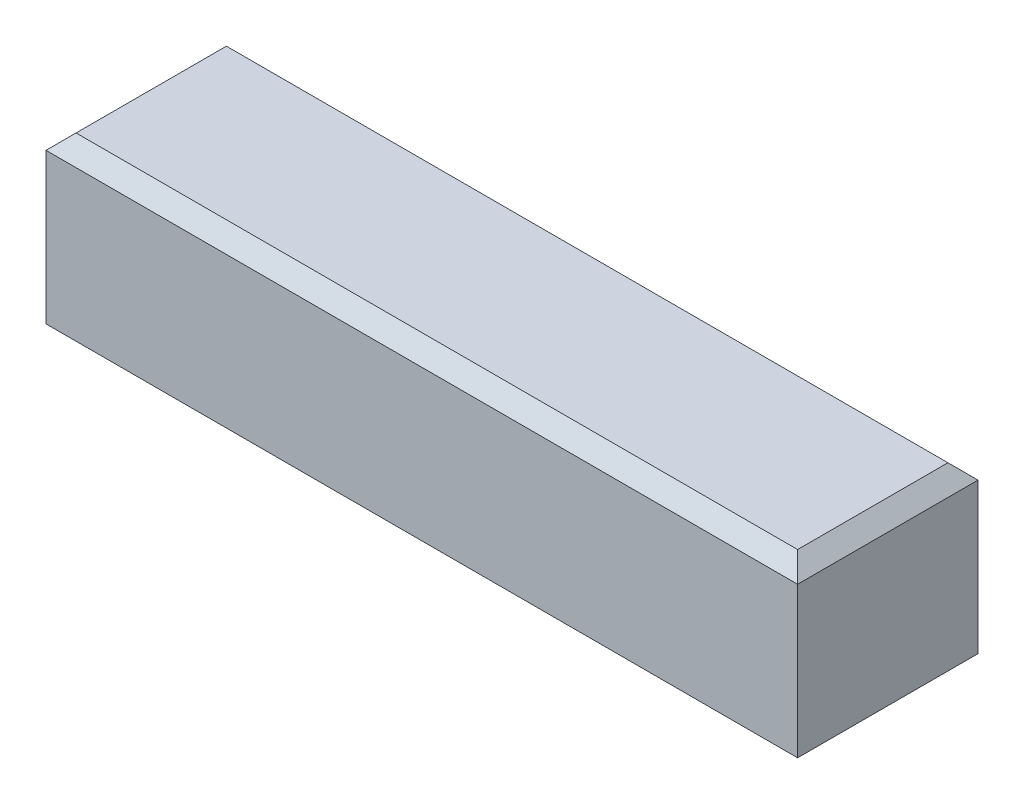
ISO-10303-21;
HEADER;
FILE_DESCRIPTION(('STEP AP214'),'2;1');
FILE_NAME('part.step','',(''),(''),'','','');
FILE_SCHEMA(('AUTOMOTIVE_DESIGN { 1 0 10303 214 1 1 1 1 }'));
ENDSEC;
DATA;
#1=APPLICATION_CONTEXT('core data for automotive mechanical design processes');
#2=APPLICATION_PROTOCOL_DEFINITION('international standard','automotive_design',2000,#1);
#3=PRODUCT_CONTEXT('',#1,'mechanical');
#4=PRODUCT('Part','Part','',(#3));
#5=PRODUCT_RELATED_PRODUCT_CATEGORY('part','',(#4));
#6=PRODUCT_DEFINITION_FORMATION('','',#4);
#7=PRODUCT_DEFINITION_CONTEXT('part definition',#1,'design');
#8=PRODUCT_DEFINITION('design','',#6,#7);
#9=PRODUCT_DEFINITION_SHAPE('','',#8);
#10=(LENGTH_UNIT() NAMED_UNIT(*) SI_UNIT(.MILLI.,.METRE.));
#11=(NAMED_UNIT(*) PLANE_ANGLE_UNIT() SI_UNIT($,.RADIAN.));
#12=(NAMED_UNIT(*) SI_UNIT($,.STERADIAN.) SOLID_ANGLE_UNIT());
#13=UNCERTAINTY_MEASURE_WITH_UNIT(LENGTH_MEASURE(1.E-05),#10,'distance_accuracy_value','');
#14=(GEOMETRIC_REPRESENTATION_CONTEXT(3) GLOBAL_UNCERTAINTY_ASSIGNED_CONTEXT((#13)) GLOBAL_UNIT_ASSIGNED_CONTEXT((#10,
#11,#12)) REPRESENTATION_CONTEXT('',''));
#15=CARTESIAN_POINT('',(0.,0.,0.));
#16=DIRECTION('',(0.,0.,1.));
#17=DIRECTION('',(1.,0.,0.));
#18=AXIS2_PLACEMENT_3D('',#15,#16,#17);
#19=CARTESIAN_POINT('',(-12.5,3.,6.));
#20=DIRECTION('',(1.,0.,0.));
#21=DIRECTION('',(0.,0.,-1.));
#22=AXIS2_PLACEMENT_3D('',#19,#20,#21);
#23=PLANE('',#22);
#24=DIRECTION('',(0.,-1.,0.));
#25=VECTOR('',#24,1.);
#26=CARTESIAN_POINT('',(-12.5,3.,0.));
#27=LINE('',#26,#25);
#28=CARTESIAN_POINT('',(-12.5,2.5,0.));
#29=VERTEX_POINT('',#28);
#30=CARTESIAN_POINT('',(-12.5,-2.49999999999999,0.));
#31=VERTEX_POINT('',#30);
#32=EDGE_CURVE('E132',#29,#31,#27,.T.);
#33=ORIENTED_EDGE('',*,*,#32,.T.);
#34=DIRECTION('',(0.,0.,1.));
#35=VECTOR('',#34,1.);
#36=CARTESIAN_POINT('',(-12.5,-2.49999999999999,6.));
#37=LINE('',#36,#35);
#38=CARTESIAN_POINT('',(-12.5,-2.49999999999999,6.));
#39=VERTEX_POINT('',#38);
#40=EDGE_CURVE('E151',#31,#39,#37,.T.);
#41=ORIENTED_EDGE('',*,*,#40,.T.);
#42=DIRECTION('',(0.,-1.,0.));
#43=VECTOR('',#42,1.);
#44=CARTESIAN_POINT('',(-12.5,3.,6.));
#45=LINE('',#44,#43);
#46=CARTESIAN_POINT('',(-12.5,2.49999999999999,6.));
#47=VERTEX_POINT('',#46);
#48=EDGE_CURVE('E131',#47,#39,#45,.T.);
#49=ORIENTED_EDGE('',*,*,#48,.F.);
#50=DIRECTION('',(0.,0.,-1.));
#51=VECTOR('',#50,1.);
#52=CARTESIAN_POINT('',(-12.5,2.49999999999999,6.));
#53=LINE('',#52,#51);
#54=EDGE_CURVE('E148',#47,#29,#53,.T.);
#55=ORIENTED_EDGE('',*,*,#54,.T.);
#56=EDGE_LOOP('',(#33,#41,#49,#55));
#57=FACE_BOUND('',#56,.T.);
#58=ADVANCED_FACE('F30',(#57),#23,.F.);
#59=CARTESIAN_POINT('',(-12.5,-3.,6.));
#60=DIRECTION('',(0.,1.,0.));
#61=DIRECTION('',(0.,0.,1.));
#62=AXIS2_PLACEMENT_3D('',#59,#60,#61);
#63=PLANE('',#62);
#64=DIRECTION('',(0.,0.,-1.));
#65=VECTOR('',#64,1.);
#66=CARTESIAN_POINT('',(-12.,-3.,6.));
#67=LINE('',#66,#65);
#68=CARTESIAN_POINT('',(-12.,-3.,5.5));
#69=VERTEX_POINT('',#68);
#70=CARTESIAN_POINT('',(-12.,-3.,0.500000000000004));
#71=VERTEX_POINT('',#70);
#72=EDGE_CURVE('E143',#69,#71,#67,.T.);
#73=ORIENTED_EDGE('',*,*,#72,.T.);
#74=DIRECTION('',(1.,0.,0.));
#75=VECTOR('',#74,1.);
#76=CARTESIAN_POINT('',(-12.5,-3.,0.500000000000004));
#77=LINE('',#76,#75);
#78=CARTESIAN_POINT('',(12.,-3.,0.500000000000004));
#79=VERTEX_POINT('',#78);
#80=EDGE_CURVE('E146',#71,#79,#77,.T.);
#81=ORIENTED_EDGE('',*,*,#80,.T.);
#82=DIRECTION('',(0.,0.,1.));
#83=VECTOR('',#82,1.);
#84=CARTESIAN_POINT('',(12.,-3.,6.));
#85=LINE('',#84,#83);
#86=CARTESIAN_POINT('',(12.,-3.,5.5));
#87=VERTEX_POINT('',#86);
#88=EDGE_CURVE('E100',#79,#87,#85,.T.);
#89=ORIENTED_EDGE('',*,*,#88,.T.);
#90=DIRECTION('',(-1.,0.,0.));
#91=VECTOR('',#90,1.);
#92=CARTESIAN_POINT('',(-12.5,-3.,5.5));
#93=LINE('',#92,#91);
#94=EDGE_CURVE('E126',#87,#69,#93,.T.);
#95=ORIENTED_EDGE('',*,*,#94,.T.);
#96=EDGE_LOOP('',(#73,#81,#89,#95));
#97=FACE_BOUND('',#96,.T.);
#98=ADVANCED_FACE('F201',(#97),#63,.F.);
#99=CARTESIAN_POINT('',(12.5,3.,6.));
#100=DIRECTION('',(-1.,0.,0.));
#101=DIRECTION('',(0.,-1.,0.));
#102=AXIS2_PLACEMENT_3D('',#99,#100,#101);
#103=PLANE('',#102);
#104=DIRECTION('',(0.,1.,0.));
#105=VECTOR('',#104,1.);
#106=CARTESIAN_POINT('',(12.5,3.,6.));
#107=LINE('',#106,#105);
#108=CARTESIAN_POINT('',(12.5,-2.49999999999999,6.));
#109=VERTEX_POINT('',#108);
#110=CARTESIAN_POINT('',(12.5,2.49999999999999,6.));
#111=VERTEX_POINT('',#110);
#112=EDGE_CURVE('E124',#109,#111,#107,.T.);
#113=ORIENTED_EDGE('',*,*,#112,.F.);
#114=DIRECTION('',(0.,0.,-1.));
#115=VECTOR('',#114,1.);
#116=CARTESIAN_POINT('',(12.5,-2.49999999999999,6.));
#117=LINE('',#116,#115);
#118=CARTESIAN_POINT('',(12.5,-2.49999999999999,0.));
#119=VERTEX_POINT('',#118);
#120=EDGE_CURVE('E98',#109,#119,#117,.T.);
#121=ORIENTED_EDGE('',*,*,#120,.T.);
#122=DIRECTION('',(0.,1.,0.));
#123=VECTOR('',#122,1.);
#124=CARTESIAN_POINT('',(12.5,3.,0.));
#125=LINE('',#124,#123);
#126=CARTESIAN_POINT('',(12.5,2.5,0.));
#127=VERTEX_POINT('',#126);
#128=EDGE_CURVE('E121',#119,#127,#125,.T.);
#129=ORIENTED_EDGE('',*,*,#128,.T.);
#130=DIRECTION('',(0.,0.,1.));
#131=VECTOR('',#130,1.);
#132=CARTESIAN_POINT('',(12.5,2.5,6.));
#133=LINE('',#132,#131);
#134=EDGE_CURVE('E127',#127,#111,#133,.T.);
#135=ORIENTED_EDGE('',*,*,#134,.T.);
#136=EDGE_LOOP('',(#113,#121,#129,#135));
#137=FACE_BOUND('',#136,.T.);
#138=ADVANCED_FACE('F120',(#137),#103,.F.);
#139=CARTESIAN_POINT('',(-12.5,3.,6.));
#140=DIRECTION('',(0.,-1.,0.));
#141=DIRECTION('',(0.,0.,-1.));
#142=AXIS2_PLACEMENT_3D('',#139,#140,#141);
#143=PLANE('',#142);
#144=DIRECTION('',(0.,0.,-1.));
#145=VECTOR('',#144,1.);
#146=CARTESIAN_POINT('',(12.,3.,6.));
#147=LINE('',#146,#145);
#148=CARTESIAN_POINT('',(12.,3.,5.5));
#149=VERTEX_POINT('',#148);
#150=CARTESIAN_POINT('',(12.,3.,0.500000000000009));
#151=VERTEX_POINT('',#150);
#152=EDGE_CURVE('E49',#149,#151,#147,.T.);
#153=ORIENTED_EDGE('',*,*,#152,.T.);
#154=DIRECTION('',(-1.,0.,0.));
#155=VECTOR('',#154,1.);
#156=CARTESIAN_POINT('',(-12.5,3.,0.500000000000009));
#157=LINE('',#156,#155);
#158=CARTESIAN_POINT('',(-12.,3.,0.500000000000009));
#159=VERTEX_POINT('',#158);
#160=EDGE_CURVE('E44',#151,#159,#157,.T.);
#161=ORIENTED_EDGE('',*,*,#160,.T.);
#162=DIRECTION('',(0.,0.,1.));
#163=VECTOR('',#162,1.);
#164=CARTESIAN_POINT('',(-12.,3.,6.));
#165=LINE('',#164,#163);
#166=CARTESIAN_POINT('',(-12.,3.,5.5));
#167=VERTEX_POINT('',#166);
#168=EDGE_CURVE('E156',#159,#167,#165,.T.);
#169=ORIENTED_EDGE('',*,*,#168,.T.);
#170=DIRECTION('',(1.,0.,0.));
#171=VECTOR('',#170,1.);
#172=CARTESIAN_POINT('',(12.5,3.,5.5));
#173=LINE('',#172,#171);
#174=EDGE_CURVE('E153',#167,#149,#173,.T.);
#175=ORIENTED_EDGE('',*,*,#174,.T.);
#176=EDGE_LOOP('',(#153,#161,#169,#175));
#177=FACE_BOUND('',#176,.T.);
#178=ADVANCED_FACE('F193',(#177),#143,.F.);
#179=CARTESIAN_POINT('',(-12.5,-3.,6.));
#180=DIRECTION('',(0.,0.,1.));
#181=DIRECTION('',(1.,0.,0.));
#182=AXIS2_PLACEMENT_3D('',#179,#180,#181);
#183=PLANE('',#182);
#184=ORIENTED_EDGE('',*,*,#112,.T.);
#185=DIRECTION('',(-1.,0.,0.));
#186=VECTOR('',#185,1.);
#187=CARTESIAN_POINT('',(-12.5,2.49999999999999,6.));
#188=LINE('',#187,#186);
#189=EDGE_CURVE('E11',#111,#47,#188,.T.);
#190=ORIENTED_EDGE('',*,*,#189,.T.);
#191=ORIENTED_EDGE('',*,*,#48,.T.);
#192=DIRECTION('',(1.,0.,0.));
#193=VECTOR('',#192,1.);
#194=CARTESIAN_POINT('',(12.5,-2.49999999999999,6.));
#195=LINE('',#194,#193);
#196=EDGE_CURVE('E37',#39,#109,#195,.T.);
#197=ORIENTED_EDGE('',*,*,#196,.T.);
#198=EDGE_LOOP('',(#184,#190,#191,#197));
#199=FACE_BOUND('',#198,.T.);
#200=ADVANCED_FACE('F161',(#199),#183,.T.);
#201=CARTESIAN_POINT('',(-12.5,-3.,0.));
#202=DIRECTION('',(0.,0.,1.));
#203=DIRECTION('',(1.,0.,0.));
#204=AXIS2_PLACEMENT_3D('',#201,#202,#203);
#205=PLANE('',#204);
#206=ORIENTED_EDGE('',*,*,#128,.F.);
#207=DIRECTION('',(-1.,0.,0.));
#208=VECTOR('',#207,1.);
#209=CARTESIAN_POINT('',(-12.5,-2.49999999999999,0.));
#210=LINE('',#209,#208);
#211=EDGE_CURVE('E107',#119,#31,#210,.T.);
#212=ORIENTED_EDGE('',*,*,#211,.T.);
#213=ORIENTED_EDGE('',*,*,#32,.F.);
#214=DIRECTION('',(1.,0.,0.));
#215=VECTOR('',#214,1.);
#216=CARTESIAN_POINT('',(-12.5,2.5,0.));
#217=LINE('',#216,#215);
#218=EDGE_CURVE('E115',#29,#127,#217,.T.);
#219=ORIENTED_EDGE('',*,*,#218,.T.);
#220=EDGE_LOOP('',(#206,#212,#213,#219));
#221=FACE_BOUND('',#220,.T.);
#222=ADVANCED_FACE('F129',(#221),#205,.F.);
#223=CARTESIAN_POINT('',(-12.,-3.,6.));
#224=DIRECTION('',(0.707106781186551,0.707106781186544,0.));
#225=DIRECTION('',(-0.707106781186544,0.707106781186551,0.));
#226=AXIS2_PLACEMENT_3D('',#223,#224,#225);
#227=PLANE('',#226);
#228=DIRECTION('',(-0.577350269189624,0.57735026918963,-0.577350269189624));
#229=VECTOR('',#228,1.);
#230=CARTESIAN_POINT('',(-12.1666666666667,-2.83333333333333,0.333333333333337));
#231=LINE('',#230,#229);
#232=EDGE_CURVE('E110',#71,#31,#231,.T.);
#233=ORIENTED_EDGE('',*,*,#232,.F.);
#234=ORIENTED_EDGE('',*,*,#72,.F.);
#235=DIRECTION('',(-0.577350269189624,0.57735026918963,0.577350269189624));
#236=VECTOR('',#235,1.);
#237=CARTESIAN_POINT('',(-12.5,-2.49999999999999,6.));
#238=LINE('',#237,#236);
#239=EDGE_CURVE('E136',#39,#69,#238,.F.);
#240=ORIENTED_EDGE('',*,*,#239,.F.);
#241=ORIENTED_EDGE('',*,*,#40,.F.);
#242=EDGE_LOOP('',(#233,#234,#240,#241));
#243=FACE_BOUND('',#242,.T.);
#244=ADVANCED_FACE('F212',(#243),#227,.F.);
#245=CARTESIAN_POINT('',(-12.5,-2.49999999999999,6.));
#246=DIRECTION('',(0.,-0.707106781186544,0.707106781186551));
#247=DIRECTION('',(0.,-0.707106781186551,-0.707106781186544));
#248=AXIS2_PLACEMENT_3D('',#245,#246,#247);
#249=PLANE('',#248);
#250=ORIENTED_EDGE('',*,*,#239,.T.);
#251=ORIENTED_EDGE('',*,*,#94,.F.);
#252=DIRECTION('',(-0.577350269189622,-0.57735026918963,-0.577350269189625));
#253=VECTOR('',#252,1.);
#254=CARTESIAN_POINT('',(4.16666666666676,-10.8333333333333,-2.33333333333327));
#255=LINE('',#254,#253);
#256=EDGE_CURVE('E103',#109,#87,#255,.T.);
#257=ORIENTED_EDGE('',*,*,#256,.F.);
#258=ORIENTED_EDGE('',*,*,#196,.F.);
#259=EDGE_LOOP('',(#250,#251,#257,#258));
#260=FACE_BOUND('',#259,.T.);
#261=ADVANCED_FACE('F167',(#260),#249,.T.);
#262=CARTESIAN_POINT('',(-12.5,-3.,0.500000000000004));
#263=DIRECTION('',(0.,0.707106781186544,0.707106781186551));
#264=DIRECTION('',(0.,-0.707106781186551,0.707106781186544));
#265=AXIS2_PLACEMENT_3D('',#262,#263,#264);
#266=PLANE('',#265);
#267=ORIENTED_EDGE('',*,*,#232,.T.);
#268=ORIENTED_EDGE('',*,*,#211,.F.);
#269=DIRECTION('',(-0.577350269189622,-0.57735026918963,0.577350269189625));
#270=VECTOR('',#269,1.);
#271=CARTESIAN_POINT('',(3.83333333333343,-11.1666666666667,8.66666666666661));
#272=LINE('',#271,#270);
#273=EDGE_CURVE('E94',#79,#119,#272,.F.);
#274=ORIENTED_EDGE('',*,*,#273,.F.);
#275=ORIENTED_EDGE('',*,*,#80,.F.);
#276=EDGE_LOOP('',(#267,#268,#274,#275));
#277=FACE_BOUND('',#276,.T.);
#278=ADVANCED_FACE('F108',(#277),#266,.F.);
#279=CARTESIAN_POINT('',(12.5,-2.49999999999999,6.));
#280=DIRECTION('',(-0.707106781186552,0.707106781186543,0.));
#281=DIRECTION('',(-0.707106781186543,-0.707106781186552,0.));
#282=AXIS2_PLACEMENT_3D('',#279,#280,#281);
#283=PLANE('',#282);
#284=ORIENTED_EDGE('',*,*,#256,.T.);
#285=ORIENTED_EDGE('',*,*,#88,.F.);
#286=ORIENTED_EDGE('',*,*,#273,.T.);
#287=ORIENTED_EDGE('',*,*,#120,.F.);
#288=EDGE_LOOP('',(#284,#285,#286,#287));
#289=FACE_BOUND('',#288,.T.);
#290=ADVANCED_FACE('F96',(#289),#283,.F.);
#291=CARTESIAN_POINT('',(12.,3.,6.));
#292=DIRECTION('',(-0.707106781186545,-0.70710678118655,0.));
#293=DIRECTION('',(0.70710678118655,-0.707106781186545,0.));
#294=AXIS2_PLACEMENT_3D('',#291,#292,#293);
#295=PLANE('',#294);
#296=DIRECTION('',(0.577350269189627,-0.577350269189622,-0.577350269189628));
#297=VECTOR('',#296,1.);
#298=CARTESIAN_POINT('',(3.8333333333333,11.1666666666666,8.66666666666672));
#299=LINE('',#298,#297);
#300=EDGE_CURVE('E174',#151,#127,#299,.T.);
#301=ORIENTED_EDGE('',*,*,#300,.F.);
#302=ORIENTED_EDGE('',*,*,#152,.F.);
#303=DIRECTION('',(0.577350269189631,-0.577350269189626,0.57735026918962));
#304=VECTOR('',#303,1.);
#305=CARTESIAN_POINT('',(4.16666666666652,10.8333333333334,-2.33333333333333));
#306=LINE('',#305,#304);
#307=EDGE_CURVE('E104',#111,#149,#306,.F.);
#308=ORIENTED_EDGE('',*,*,#307,.F.);
#309=ORIENTED_EDGE('',*,*,#134,.F.);
#310=EDGE_LOOP('',(#301,#302,#308,#309));
#311=FACE_BOUND('',#310,.T.);
#312=ADVANCED_FACE('F226',(#311),#295,.F.);
#313=CARTESIAN_POINT('',(-12.5,2.49999999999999,6.));
#314=DIRECTION('',(0.,0.707106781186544,0.707106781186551));
#315=DIRECTION('',(0.,-0.707106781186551,0.707106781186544));
#316=AXIS2_PLACEMENT_3D('',#313,#314,#315);
#317=PLANE('',#316);
#318=ORIENTED_EDGE('',*,*,#307,.T.);
#319=ORIENTED_EDGE('',*,*,#174,.F.);
#320=DIRECTION('',(0.577350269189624,0.57735026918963,-0.577350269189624));
#321=VECTOR('',#320,1.);
#322=CARTESIAN_POINT('',(-12.5,2.49999999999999,6.));
#323=LINE('',#322,#321);
#324=EDGE_CURVE('E177',#47,#167,#323,.T.);
#325=ORIENTED_EDGE('',*,*,#324,.F.);
#326=ORIENTED_EDGE('',*,*,#189,.F.);
#327=EDGE_LOOP('',(#318,#319,#325,#326));
#328=FACE_BOUND('',#327,.T.);
#329=ADVANCED_FACE('F192',(#328),#317,.T.);
#330=CARTESIAN_POINT('',(-12.5,3.,0.500000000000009));
#331=DIRECTION('',(0.,-0.707106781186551,0.707106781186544));
#332=DIRECTION('',(0.,-0.707106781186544,-0.707106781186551));
#333=AXIS2_PLACEMENT_3D('',#330,#331,#332);
#334=PLANE('',#333);
#335=ORIENTED_EDGE('',*,*,#300,.T.);
#336=ORIENTED_EDGE('',*,*,#218,.F.);
#337=DIRECTION('',(0.57735026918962,0.577350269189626,0.577350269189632));
#338=VECTOR('',#337,1.);
#339=CARTESIAN_POINT('',(-12.1666666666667,2.83333333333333,0.333333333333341));
#340=LINE('',#339,#338);
#341=EDGE_CURVE('E179',#159,#29,#340,.F.);
#342=ORIENTED_EDGE('',*,*,#341,.F.);
#343=ORIENTED_EDGE('',*,*,#160,.F.);
#344=EDGE_LOOP('',(#335,#336,#342,#343));
#345=FACE_BOUND('',#344,.T.);
#346=ADVANCED_FACE('F185',(#345),#334,.F.);
#347=CARTESIAN_POINT('',(-12.5,2.49999999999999,6.));
#348=DIRECTION('',(0.707106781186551,-0.707106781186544,0.));
#349=DIRECTION('',(0.707106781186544,0.707106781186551,0.));
#350=AXIS2_PLACEMENT_3D('',#347,#348,#349);
#351=PLANE('',#350);
#352=ORIENTED_EDGE('',*,*,#324,.T.);
#353=ORIENTED_EDGE('',*,*,#168,.F.);
#354=ORIENTED_EDGE('',*,*,#341,.T.);
#355=ORIENTED_EDGE('',*,*,#54,.F.);
#356=EDGE_LOOP('',(#352,#353,#354,#355));
#357=FACE_BOUND('',#356,.T.);
#358=ADVANCED_FACE('F183',(#357),#351,.F.);
#359=CLOSED_SHELL('',(#58,#98,#138,#178,#200,#222,#244,#261,#278,#290,#312,#329,#346,#358));
#360=MANIFOLD_SOLID_BREP('B2',#359);
#361=ADVANCED_BREP_SHAPE_REPRESENTATION('',(#18,#360),#14);
#362=SHAPE_DEFINITION_REPRESENTATION(#9,#361);
ENDSEC;
END-ISO-10303-21;
